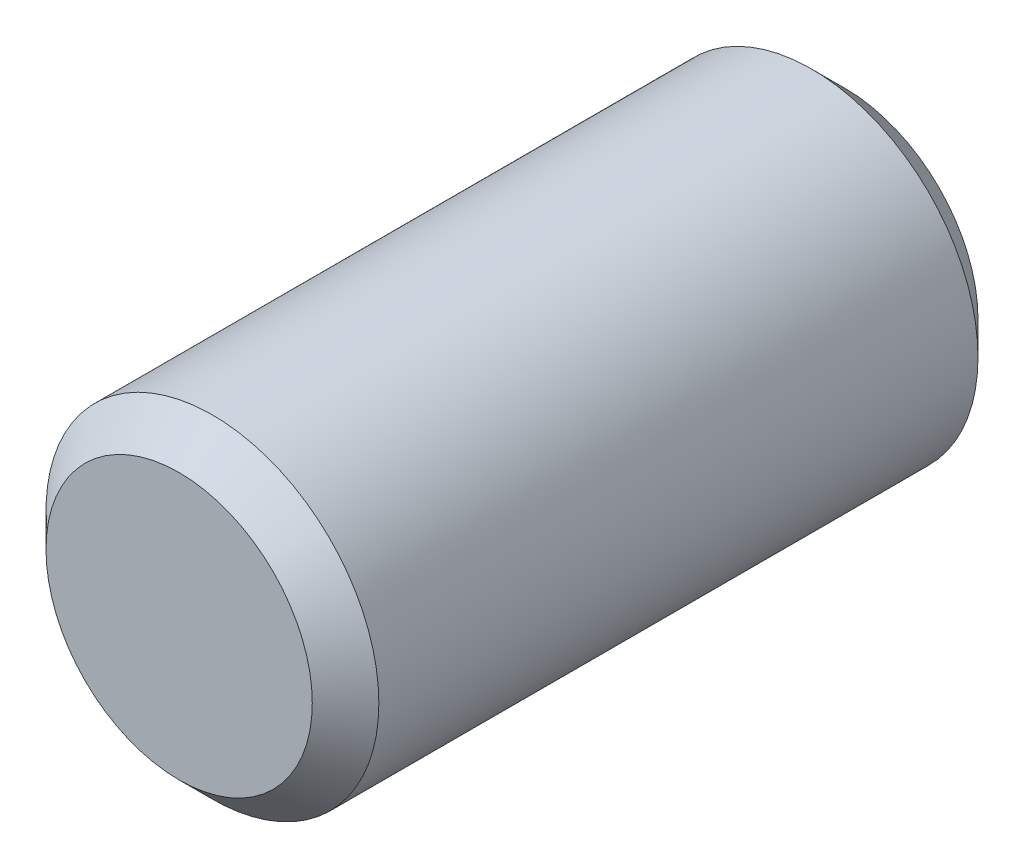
ISO-10303-21;
HEADER;
FILE_DESCRIPTION(('STEP AP214'),'2;1');
FILE_NAME('part.step','',(''),(''),'','','');
FILE_SCHEMA(('AUTOMOTIVE_DESIGN { 1 0 10303 214 1 1 1 1 }'));
ENDSEC;
DATA;
#1=APPLICATION_CONTEXT('core data for automotive mechanical design processes');
#2=APPLICATION_PROTOCOL_DEFINITION('international standard','automotive_design',2000,#1);
#3=PRODUCT_CONTEXT('',#1,'mechanical');
#4=PRODUCT('Part','Part','',(#3));
#5=PRODUCT_RELATED_PRODUCT_CATEGORY('part','',(#4));
#6=PRODUCT_DEFINITION_FORMATION('','',#4);
#7=PRODUCT_DEFINITION_CONTEXT('part definition',#1,'design');
#8=PRODUCT_DEFINITION('design','',#6,#7);
#9=PRODUCT_DEFINITION_SHAPE('','',#8);
#10=(LENGTH_UNIT() NAMED_UNIT(*) SI_UNIT(.MILLI.,.METRE.));
#11=(NAMED_UNIT(*) PLANE_ANGLE_UNIT() SI_UNIT($,.RADIAN.));
#12=(NAMED_UNIT(*) SI_UNIT($,.STERADIAN.) SOLID_ANGLE_UNIT());
#13=UNCERTAINTY_MEASURE_WITH_UNIT(LENGTH_MEASURE(1.E-05),#10,'distance_accuracy_value','');
#14=(GEOMETRIC_REPRESENTATION_CONTEXT(3) GLOBAL_UNCERTAINTY_ASSIGNED_CONTEXT((#13)) GLOBAL_UNIT_ASSIGNED_CONTEXT((#10,
#11,#12)) REPRESENTATION_CONTEXT('',''));
#15=CARTESIAN_POINT('',(0.,0.,0.));
#16=DIRECTION('',(0.,0.,1.));
#17=DIRECTION('',(1.,0.,0.));
#18=AXIS2_PLACEMENT_3D('',#15,#16,#17);
#19=CARTESIAN_POINT('',(0.,0.,4.));
#20=DIRECTION('',(0.,0.,-1.));
#21=DIRECTION('',(-1.,0.,0.));
#22=AXIS2_PLACEMENT_3D('',#19,#20,#21);
#23=CYLINDRICAL_SURFACE('',#22,1.);
#24=CARTESIAN_POINT('',(0.,0.,3.8));
#25=DIRECTION('',(0.,0.,1.));
#26=DIRECTION('',(1.,0.,0.));
#27=AXIS2_PLACEMENT_3D('',#24,#25,#26);
#28=CIRCLE('',#27,1.);
#29=CARTESIAN_POINT('',(1.,0.,3.8));
#30=VERTEX_POINT('',#29);
#31=EDGE_CURVE('E31',#30,#30,#28,.F.);
#32=ORIENTED_EDGE('',*,*,#31,.T.);
#33=EDGE_LOOP('',(#32));
#34=FACE_BOUND('',#33,.T.);
#35=CARTESIAN_POINT('',(0.,0.,0.200000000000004));
#36=DIRECTION('',(0.,0.,1.));
#37=DIRECTION('',(1.,0.,0.));
#38=AXIS2_PLACEMENT_3D('',#35,#36,#37);
#39=CIRCLE('',#38,1.);
#40=CARTESIAN_POINT('',(1.,0.,0.200000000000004));
#41=VERTEX_POINT('',#40);
#42=EDGE_CURVE('E35',#41,#41,#39,.T.);
#43=ORIENTED_EDGE('',*,*,#42,.T.);
#44=EDGE_LOOP('',(#43));
#45=FACE_BOUND('',#44,.T.);
#46=ADVANCED_FACE('F25',(#34,#45),#23,.T.);
#47=CARTESIAN_POINT('',(0.,0.,4.));
#48=DIRECTION('',(0.,0.,1.));
#49=DIRECTION('',(1.,0.,0.));
#50=AXIS2_PLACEMENT_3D('',#47,#48,#49);
#51=PLANE('',#50);
#52=CARTESIAN_POINT('',(0.,0.,4.));
#53=DIRECTION('',(0.,0.,1.));
#54=DIRECTION('',(1.,0.,0.));
#55=AXIS2_PLACEMENT_3D('',#52,#53,#54);
#56=CIRCLE('',#55,0.799999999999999);
#57=CARTESIAN_POINT('',(0.799999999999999,0.,4.));
#58=VERTEX_POINT('',#57);
#59=EDGE_CURVE('E39',#58,#58,#56,.T.);
#60=ORIENTED_EDGE('',*,*,#59,.T.);
#61=EDGE_LOOP('',(#60));
#62=FACE_BOUND('',#61,.T.);
#63=ADVANCED_FACE('F45',(#62),#51,.T.);
#64=CARTESIAN_POINT('',(0.,0.,0.));
#65=DIRECTION('',(0.,0.,1.));
#66=DIRECTION('',(1.,0.,0.));
#67=AXIS2_PLACEMENT_3D('',#64,#65,#66);
#68=PLANE('',#67);
#69=CARTESIAN_POINT('',(0.,0.,0.));
#70=DIRECTION('',(0.,0.,1.));
#71=DIRECTION('',(1.,0.,0.));
#72=AXIS2_PLACEMENT_3D('',#69,#70,#71);
#73=CIRCLE('',#72,0.799999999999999);
#74=CARTESIAN_POINT('',(0.799999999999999,0.,0.));
#75=VERTEX_POINT('',#74);
#76=EDGE_CURVE('E10',#75,#75,#73,.F.);
#77=ORIENTED_EDGE('',*,*,#76,.T.);
#78=EDGE_LOOP('',(#77));
#79=FACE_BOUND('',#78,.T.);
#80=ADVANCED_FACE('F50',(#79),#68,.F.);
#81=CARTESIAN_POINT('',(0.,0.,4.));
#82=DIRECTION('',(0.,0.,-1.));
#83=DIRECTION('',(-1.,0.,0.));
#84=AXIS2_PLACEMENT_3D('',#81,#82,#83);
#85=CONICAL_SURFACE('',#84,0.799999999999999,0.785398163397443);
#86=ORIENTED_EDGE('',*,*,#31,.F.);
#87=EDGE_LOOP('',(#86));
#88=FACE_BOUND('',#87,.T.);
#89=ORIENTED_EDGE('',*,*,#59,.F.);
#90=EDGE_LOOP('',(#89));
#91=FACE_BOUND('',#90,.T.);
#92=ADVANCED_FACE('F47',(#88,#91),#85,.T.);
#93=CARTESIAN_POINT('',(0.,0.,0.200000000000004));
#94=DIRECTION('',(0.,0.,1.));
#95=DIRECTION('',(1.,0.,0.));
#96=AXIS2_PLACEMENT_3D('',#93,#94,#95);
#97=CONICAL_SURFACE('',#96,1.,0.785398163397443);
#98=ORIENTED_EDGE('',*,*,#76,.F.);
#99=EDGE_LOOP('',(#98));
#100=FACE_BOUND('',#99,.T.);
#101=ORIENTED_EDGE('',*,*,#42,.F.);
#102=EDGE_LOOP('',(#101));
#103=FACE_BOUND('',#102,.T.);
#104=ADVANCED_FACE('F49',(#100,#103),#97,.T.);
#105=CLOSED_SHELL('',(#46,#63,#80,#92,#104));
#106=MANIFOLD_SOLID_BREP('B2',#105);
#107=ADVANCED_BREP_SHAPE_REPRESENTATION('',(#18,#106),#14);
#108=SHAPE_DEFINITION_REPRESENTATION(#9,#107);
ENDSEC;
END-ISO-10303-21;
